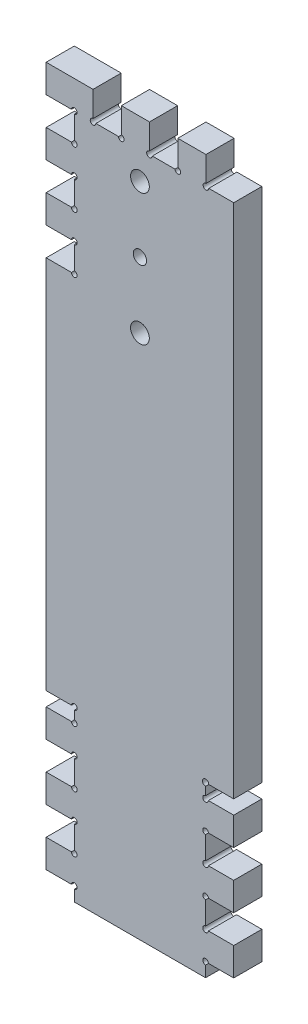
from build123d import *

# Parameters (mm, degrees)
AUFSATZ_LINEAR_AUSTRAGEN1_DEPTH = 15
SKIZZE3_R                       = 3.55
SCHNITT_LINEAR_AUSTRAGEN3_DEPTH = 17.5
SKIZZE4_R                       = 5
SCHNITT_LINEAR_AUSTRAGEN4_DEPTH = 7.5


with BuildPart() as part:
    # Skizze1 → Aufsatz-Linear austragen1 (new body)
    with BuildSketch(Plane.XY):
        with BuildLine():
            Line((0, 82.6), (13.5, 82.6))
            ThreePointArc((13.5, 82.6), (16.060660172, 81.539339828), (15, 84.1))
            Line((15, 84.1), (15, 88.6))
            ThreePointArc((15, 88.6), (16.060660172, 91.160660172), (13.5, 90.1))
            Line((13.5, 90.1), (0, 90.1))
            Line((0, 90.1), (0, 289.970539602))
            Line((0, 289.970539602), (13.5, 289.970539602))
            ThreePointArc((13.5, 289.970539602), (16.060660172, 288.909879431), (15, 291.470539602))
            Line((15, 291.470539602), (15, 303.570539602))
            ThreePointArc((15, 303.570539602), (16.060660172, 306.131199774), (13.5, 305.070539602))
            Line((13.5, 305.070539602), (0, 305.070539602))
            Line((0, 305.070539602), (0, 320.070539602))
            Line((0, 320.070539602), (13.5, 320.070539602))
            ThreePointArc((13.5, 320.070539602), (16.060660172, 319.009879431), (15, 321.570539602))
            Line((15, 321.570539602), (15, 333.670539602))
            ThreePointArc((15, 333.670539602), (16.060660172, 336.231199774), (13.5, 335.170539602))
            Line((13.5, 335.170539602), (0, 335.170539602))
            Line((0, 335.170539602), (0, 350.170539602))
            Line((0, 350.170539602), (13.5, 350.170539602))
            ThreePointArc((13.5, 350.170539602), (16.060660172, 349.109879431), (15, 351.670539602))
            Line((15, 351.670539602), (15, 363.770539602))
            ThreePointArc((15, 363.770539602), (16.060660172, 366.331199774), (13.5, 365.270539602))
            Line((13.5, 365.270539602), (0, 365.270539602))
            Line((0, 365.270539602), (0, 380.270539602))
            Line((0, 380.270539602), (25, 380.270539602))
            Line((25, 380.270539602), (25, 366.770543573))
            ThreePointArc((25, 366.770543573), (23.939339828, 364.209883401), (26.5, 365.270543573))
            Line((26.5, 365.270543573), (38.6, 365.270543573))
            ThreePointArc((38.6, 365.270543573), (41.160660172, 364.209883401), (40.1, 366.770543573))
            Line((40.1, 366.770543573), (40.1, 380.270539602))
            Line((40.1, 380.270539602), (55.1, 380.270539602))
            Line((55.1, 380.270539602), (54.968914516, 366.764800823))
            ThreePointArc((54.968914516, 366.764800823), (54.086744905, 364.16450429), (56.6, 365.270539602))
            Line((56.6, 365.270539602), (68.7, 365.270539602))
            ThreePointArc((68.7, 365.270539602), (71.260660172, 364.209879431), (70.2, 366.770539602))
            Line((70.2, 366.770539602), (70.2, 380.270539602))
            Line((70.2, 380.270539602), (85.2, 380.270539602))
            Line((85.2, 380.270539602), (85.2, 366.9))
            ThreePointArc((85.2, 366.9), (84.139339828, 364.339339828), (86.7, 365.4))
            Line((86.7, 365.4), (100, 365.4))
            Line((100, 365.4), (100, 90.1))
            Line((100, 90.1), (86.7, 90.1))
            ThreePointArc((86.7, 90.1), (83.797918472, 91.302081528), (85, 88.4))
            Line((85, 88.4), (85, 84.1))
            ThreePointArc((85, 84.1), (83.939339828, 81.539339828), (86.5, 82.6))
            Line((86.5, 82.6), (100, 82.6))
            Line((100, 82.6), (100, 67.6))
            Line((100, 67.6), (86.5, 67.6))
            ThreePointArc((86.5, 67.6), (83.939339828, 68.660660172), (85, 66.1))
            Line((85, 66.1), (85, 54))
            ThreePointArc((85, 54), (83.939339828, 51.439339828), (86.5, 52.5))
            Line((86.5, 52.5), (100, 52.5))
            Line((100, 52.5), (100, 37.5))
            Line((100, 37.5), (86.5, 37.5))
            ThreePointArc((86.5, 37.5), (83.939339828, 38.560660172), (85, 36))
            Line((85, 36), (85, 23.9))
            ThreePointArc((85, 23.9), (83.939339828, 21.339339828), (86.5, 22.4))
            Line((86.5, 22.4), (100, 22.4))
            Line((100, 22.4), (100, 7.4))
            Line((100, 7.4), (86.5, 7.4))
            ThreePointArc((86.5, 7.4), (83.939339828, 8.460660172), (85, 5.9))
            Line((85, 5.9), (85, 0))
            Line((85, 0), (15, 0))
            Line((15, 0), (15, 5.9))
            ThreePointArc((15, 5.9), (16.060660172, 8.460660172), (13.5, 7.4))
            Line((13.5, 7.4), (0, 7.4))
            Line((0, 7.4), (0, 22.4))
            Line((0, 22.4), (13.5, 22.4))
            ThreePointArc((13.5, 22.4), (16.060660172, 21.339339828), (15, 23.9))
            Line((15, 23.9), (15, 36))
            ThreePointArc((15, 36), (16.060660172, 38.560660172), (13.5, 37.5))
            Line((13.5, 37.5), (0, 37.5))
            Line((0, 37.5), (0, 52.5))
            Line((0, 52.5), (13.5, 52.5))
            ThreePointArc((13.5, 52.5), (16.060660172, 51.439339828), (15, 54))
            Line((15, 54), (15, 66.1))
            ThreePointArc((15, 66.1), (16.060660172, 68.660660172), (13.5, 67.6))
            Line((13.5, 67.6), (0, 67.6))
            Line((0, 67.6), (0, 82.6))
        make_face()
    extrude(amount=AUFSATZ_LINEAR_AUSTRAGEN1_DEPTH)

    # Skizze3 → Schnitt-Linear austragen3 (cut)
    with BuildSketch(Plane(origin=(0, 0, 0), x_dir=(-1, 0, 0), z_dir=(0, 0, -1))):
        with Locations((-50, 315.270539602)):
            Circle(SKIZZE3_R)
    extrude(amount=-SCHNITT_LINEAR_AUSTRAGEN3_DEPTH, mode=Mode.SUBTRACT)

    # Skizze4 → Schnitt-Linear austragen4 (cut)
    with BuildSketch(Plane.XY.offset(15)):
        with Locations((50, 280.270539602)):
            Circle(SKIZZE4_R)
        with Locations((50, 350.270539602)):
            Circle(SKIZZE4_R)
    extrude(amount=-SCHNITT_LINEAR_AUSTRAGEN4_DEPTH, mode=Mode.SUBTRACT)


solid = part.part
